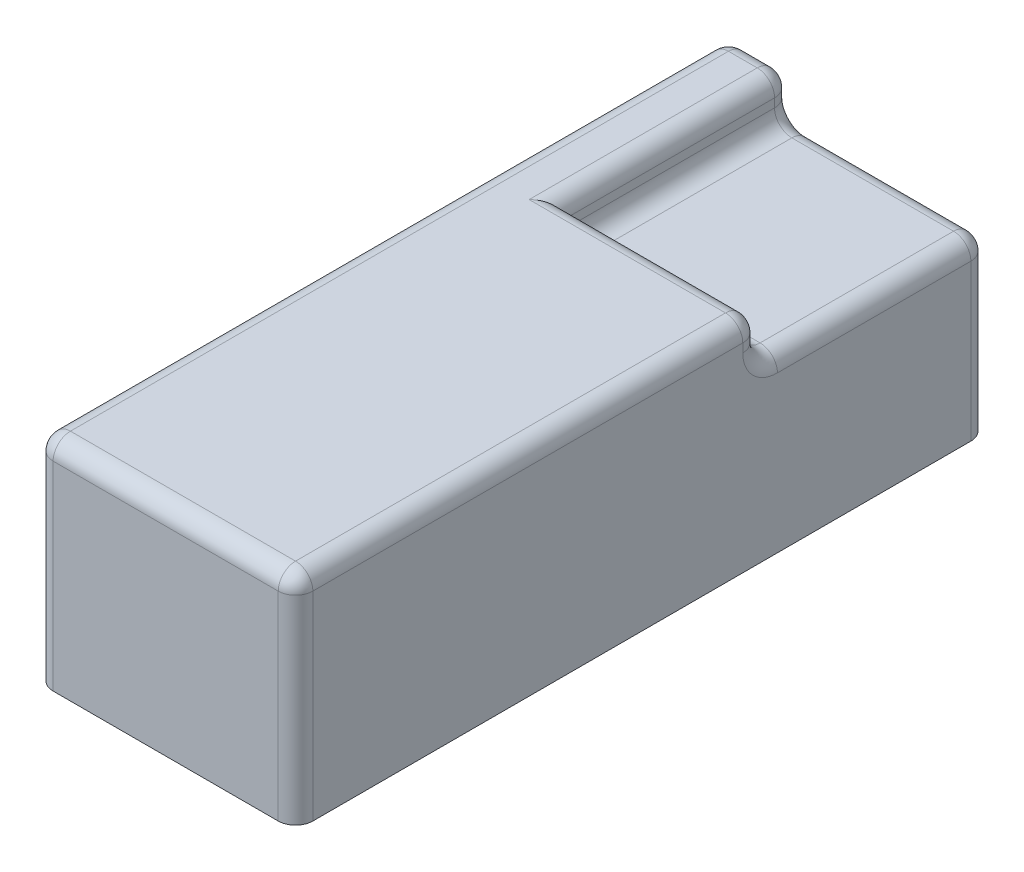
from build123d import *

# Parameters (mm, degrees)
SKETCH1_W           = 30
SKETCH1_H           = 80
BOSS_EXTRUDE1_DEPTH = 25
FILLET1_R           = 2
SKETCH2_W           = 27.498611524
SKETCH2_H           = 31.647316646
CUT_EXTRUDE1_DEPTH  = 5
FILLET2_R           = 2
SKETCH3_R           = 4.418348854
BOSS_EXTRUDE2_DEPTH = 1


with BuildPart() as part:
    # Sketch1 → Boss-Extrude1 (new body)
    with BuildSketch(Plane(origin=(0, 0, 0), x_dir=(1, 0, 0), z_dir=(0, 1, 0))):
        with Locations((15, 40)):
            Rectangle(SKETCH1_W, SKETCH1_H)
    extrude(amount=BOSS_EXTRUDE1_DEPTH)

    # Fillet1
    fillet1_edges = [part.edges().sort_by_distance(p)[0] for p in [
        (30, 25, -40),
        (15, 25, -80),
        (0, 25, -40),
        (15, 25, 0),
        (0, 12.5, -80),
        (30, 12.5, -80),
        (30, 12.5, 0),
        (0, 12.5, 0),
    ]]
    fillet(fillet1_edges, radius=FILLET1_R)

    # Sketch2 → Cut-Extrude1 (cut)
    with BuildSketch(Plane(origin=(0, 25, 0), x_dir=(1, 0, 0), z_dir=(0, 1, 0))):
        with Locations((21.073874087, 69.478592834)):
            Rectangle(SKETCH2_W, SKETCH2_H)
    extrude(amount=-CUT_EXTRUDE1_DEPTH, mode=Mode.SUBTRACT)

    # Fillet2
    fillet2_edges = [part.edges().sort_by_distance(p)[0] for p in [
        (7.324568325, 24.414213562, -79.414213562),
        (29.414213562, 24.414213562, -53.654934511),
        (29.414213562, 20, -79.414213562),
        (18.662284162, 20, -53.654934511),
        (30, 21.5, -53.654934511),
        (7.324568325, 21.5, -80),
        (7.324568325, 20, -66.827467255),
        (30, 20, -65.827467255),
        (17.662284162, 20, -80),
        (7.324568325, 25, -65.827467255),
        (17.662284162, 25, -53.654934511),
    ]]
    fillet(fillet2_edges, radius=FILLET2_R)

    # Sketch3 → Boss-Extrude2 (add)
    with BuildSketch(Plane.XZ):
        with Locations(Location((15, -71.655321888, 0), (0, 0, 270))):
            Circle(SKETCH3_R)
    extrude(amount=BOSS_EXTRUDE2_DEPTH)


solid = part.part
